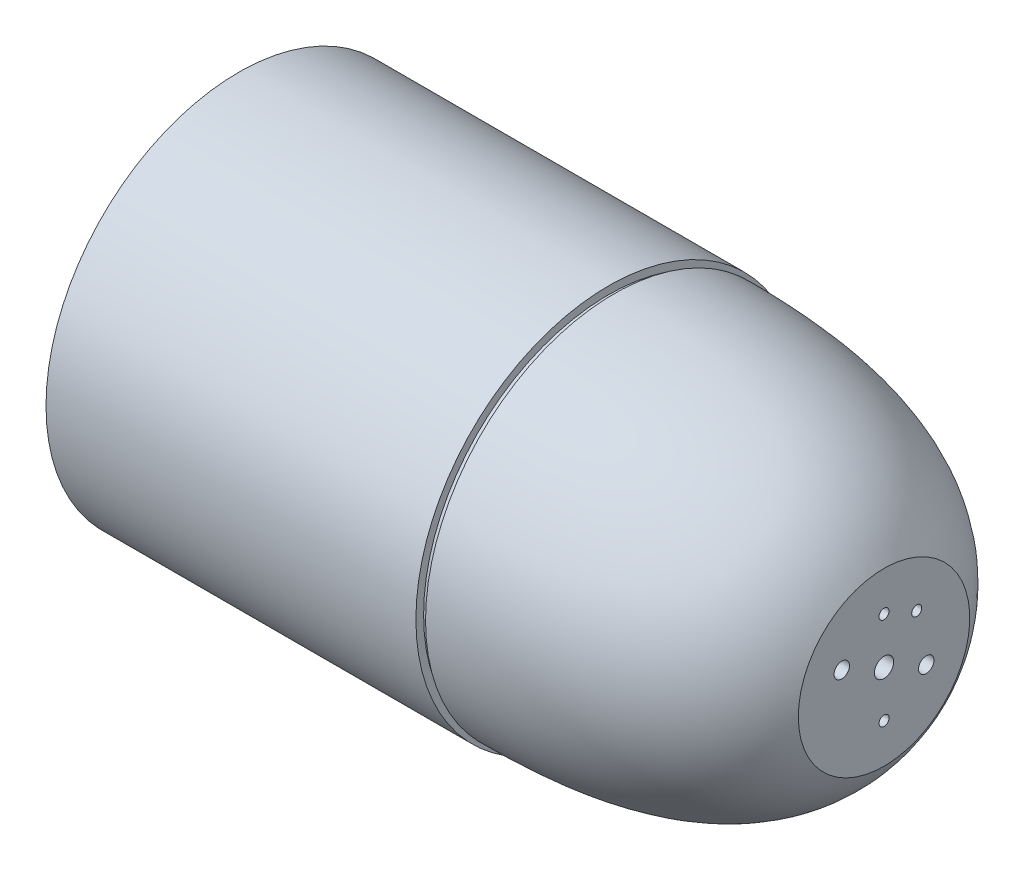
from build123d import *

# Parameters (mm, degrees)
ESQUISSE2_R                  = 5
ESQUISSE2_R_2                = 4
ESQUISSE2_R_3                = 2.6
ENL_V_MAT_EXTRU_1_DEPTH      = 356.353345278
ESQUISSE3_R                  = 2.25
ENL_V_MAT_EXTRU_2_DEPTH      = 10
R_P_TITION_CIRCULAIRE1_COUNT = 8


with BuildPart() as part:
    # Esquisse1 → R_volution1 (revolve)
    with BuildSketch(Plane.XY, mode=Mode.PRIVATE) as r_volution1_sk:
        with BuildLine():
            Line((30.6, 95), (3, 95))
            Line((3, 95), (3, 95.5))
            ThreePointArc((3, 95.5), (2.707106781, 96.207106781), (2, 96.5))
            Line((2, 96.5), (0, 96.5))
            Line((0, 96.5), (0, 100))
            Line((0, 100), (192, 100))
            Line((192, 100), (192, 96))
            Line((192, 96), (195, 96))
            Line((195, 96), (195, 97.99543874))
            add(Edge.make_bspline(
                [(335, 44.49434783), (334.786535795, 44.849873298), (334.468175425, 45.380251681), (334.036351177, 46.099062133), (333.73084238, 46.609071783), (333.355567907, 47.22965455), (332.871454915, 48.01249433), (331.999077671, 49.385069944), (330.716223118, 51.292418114), (328.574362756, 54.255698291), (325.742347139, 57.782885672), (320.904965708, 63.058722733), (314.336430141, 68.974660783), (302.9199327, 77.076496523), (287.309278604, 84.849996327), (267.376963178, 91.124787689), (250.434914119, 94.362079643), (237.071471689, 96.051925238), (227.242200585, 96.938334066), (217.705838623, 97.511564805), (210.087191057, 97.783397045), (204.241682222, 97.909923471), (199.994363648, 97.967409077), (196.949885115, 97.98832294), (195.307515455, 97.994455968), (195, 97.99543874)],
                knots=[0, 0, 0, 0, 0.007936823, 0.011905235, 0.015873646, 0.019842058, 0.023810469, 0.031747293, 0.047620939, 0.063494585, 0.095241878, 0.126989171, 0.190483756, 0.253978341, 0.380967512, 0.507956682, 0.634945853, 0.698440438, 0.761935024, 0.825429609, 0.888924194, 0.920671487, 0.95241878, 0.984166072, 0.991531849, 0.991531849, 0.991531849, 0.991531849], degree=3))
            Line((335, 44.49434783), (335, 0))
            Line((335, 0), (326, 0))
            Line((326, 0), (326, 42))
            add(Edge.make_bspline(
                [(192, 89), (231.987788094, 89), (299.10457836, 86.794429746), (326, 42)],
                knots=[0, 0, 0, 0, 1, 1, 1, 1], degree=3))
            Line((192, 89), (184.6, 89))
            Line((184.6, 89), (180, 93.6))
            Line((180, 93.6), (45, 93.6))
            Line((45, 93.6), (45, 85.5))
            Line((45, 85.5), (37, 85.5))
            Line((37, 85.5), (37, 93.6))
            Line((37, 93.6), (32, 93.6))
            Line((32, 93.6), (30.6, 95))
        make_face()
    revolve(r_volution1_sk.sketch.rotate(Axis((-4.542596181, 0, 0), (1, 0, 0)), 90), axis=Axis((-4.542596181, 0, 0), (1, 0, 0)))

    # Esquisse2 → Enl_v. mat.-Extru.1 (cut, through all)
    with BuildSketch(Plane.ZY.offset(-326)):
        Circle(ESQUISSE2_R)
        with Locations((21.925090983, 9.761679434)):
            Circle(ESQUISSE2_R_2)
        with Locations((-21.925090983, -9.761679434)):
            Circle(ESQUISSE2_R_2)
        with Locations((0, 24)):
            Circle(ESQUISSE2_R_3)
        with Locations((-16.970562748, 16.970562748)):
            Circle(ESQUISSE2_R_3)
        with Locations((0, -24)):
            Circle(ESQUISSE2_R_3)
    extrude(amount=-ENL_V_MAT_EXTRU_1_DEPTH, mode=Mode.SUBTRACT)

    # Esquisse3 → Enl_v. mat.-Extru.2 (cut)
    with BuildSketch(Plane.ZY.offset(-37)):
        with Locations((0, -89)):
            Circle(ESQUISSE3_R)
    enl_v_mat_extru_2 = extrude(amount=-ENL_V_MAT_EXTRU_2_DEPTH, mode=Mode.SUBTRACT)

    # R_p_tition circulaire1: Enl_v. mat.-Extru.2 ×8 about axis
    r_p_tition_circulaire1_axis = Axis((0, 0, 0), (1, 0, 0))
    for i in range(1, R_P_TITION_CIRCULAIRE1_COUNT):
        add(enl_v_mat_extru_2.rotate(r_p_tition_circulaire1_axis, i * 360 / R_P_TITION_CIRCULAIRE1_COUNT), mode=Mode.SUBTRACT)


solid = part.part
